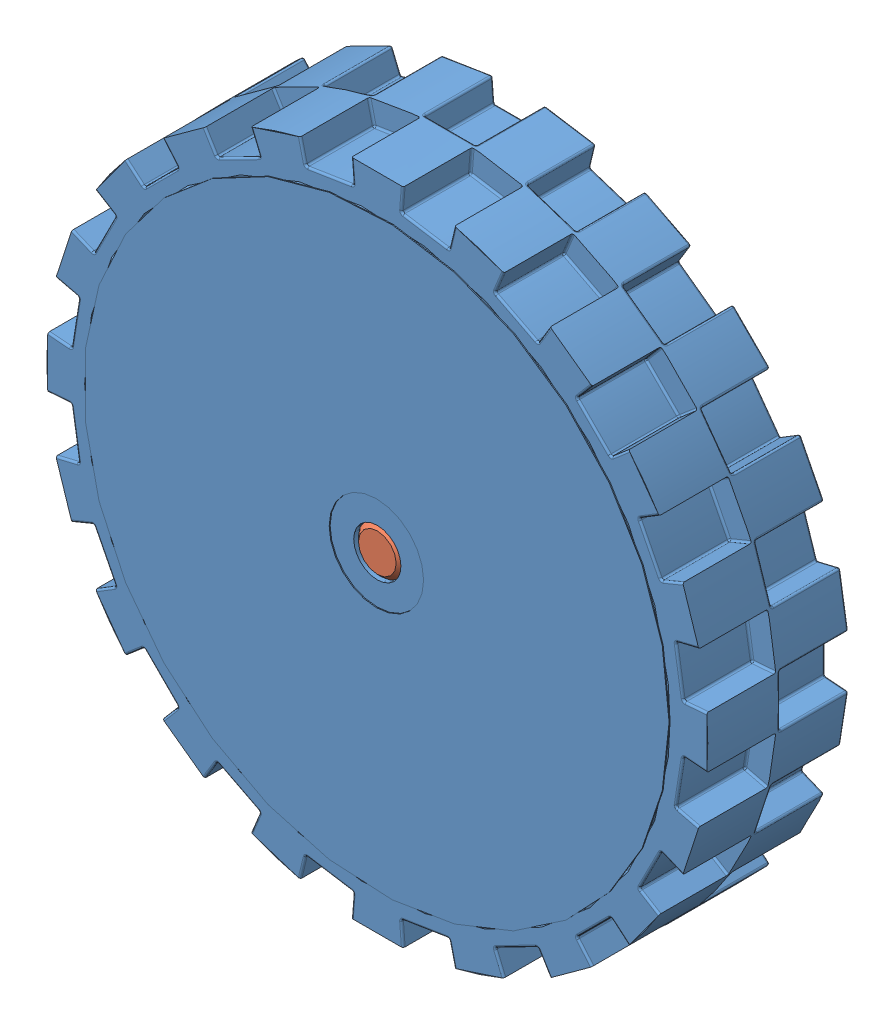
SolidWorks assembly Roue équipée.SLDASM, configuration Défaut (file format 3100). Lengths in mm.
Overall size (70 70 25.1).
3 component instances, 3 part files, 4 mates.
Components (placement in the parent):
- Roue-1: Roue.SLDPRT [Défaut] at origin size (70 70 15.1)
- Axe roue-1: Axe roue.SLDPRT [Défaut] at (0 0 -5) size (5 5 25)
- roue5_21_blanc-1: roue5_21_blanc.SLDPRT [Défaut] at (0 0 0.5) x (-0.607135 0.794599 0) z (0 0 -1) size (21.36 21.3 10)
Mates (geometry in assembly coordinates):
- Coaxiale1: concentric anti-aligned: cylinder of Roue-1; cylinder of Axe roue-1
- Coïncidente1: coincident aligned: plane of Roue-1 through (0 0 7.5) normal (0 0 1); plane of Axe roue-1 through (0 0 7.5) normal (0 0 1)
- Coaxiale2: concentric anti-aligned: cylinder of Axe roue-1; cylinder of roue5_21_blanc-1
- Distance2: distance = 8 mm aligned: plane of Axe roue-1 through (0 0 -17.5) normal (0 0 -1); plane of roue5_21_blanc-1 through (0 0 -9.5) normal (0 0 -1)
